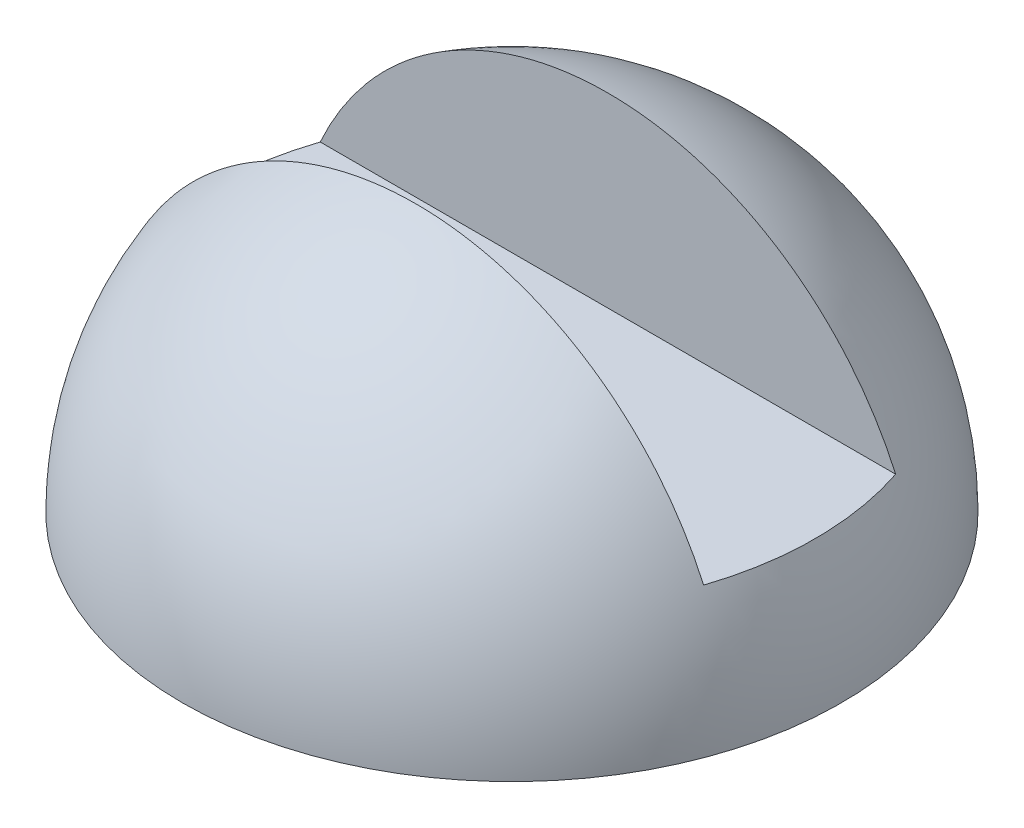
ISO-10303-21;
HEADER;
FILE_DESCRIPTION(('STEP AP214'),'2;1');
FILE_NAME('part.step','',(''),(''),'','','');
FILE_SCHEMA(('AUTOMOTIVE_DESIGN { 1 0 10303 214 1 1 1 1 }'));
ENDSEC;
DATA;
#1=APPLICATION_CONTEXT('core data for automotive mechanical design processes');
#2=APPLICATION_PROTOCOL_DEFINITION('international standard','automotive_design',2000,#1);
#3=PRODUCT_CONTEXT('',#1,'mechanical');
#4=PRODUCT('Part','Part','',(#3));
#5=PRODUCT_RELATED_PRODUCT_CATEGORY('part','',(#4));
#6=PRODUCT_DEFINITION_FORMATION('','',#4);
#7=PRODUCT_DEFINITION_CONTEXT('part definition',#1,'design');
#8=PRODUCT_DEFINITION('design','',#6,#7);
#9=PRODUCT_DEFINITION_SHAPE('','',#8);
#10=(LENGTH_UNIT() NAMED_UNIT(*) SI_UNIT(.MILLI.,.METRE.));
#11=(NAMED_UNIT(*) PLANE_ANGLE_UNIT() SI_UNIT($,.RADIAN.));
#12=(NAMED_UNIT(*) SI_UNIT($,.STERADIAN.) SOLID_ANGLE_UNIT());
#13=UNCERTAINTY_MEASURE_WITH_UNIT(LENGTH_MEASURE(1.E-05),#10,'distance_accuracy_value','');
#14=(GEOMETRIC_REPRESENTATION_CONTEXT(3) GLOBAL_UNCERTAINTY_ASSIGNED_CONTEXT((#13)) GLOBAL_UNIT_ASSIGNED_CONTEXT((#10,
#11,#12)) REPRESENTATION_CONTEXT('',''));
#15=CARTESIAN_POINT('',(0.,0.,0.));
#16=DIRECTION('',(0.,0.,1.));
#17=DIRECTION('',(1.,0.,0.));
#18=AXIS2_PLACEMENT_3D('',#15,#16,#17);
#19=CARTESIAN_POINT('',(0.,0.,0.));
#20=DIRECTION('',(0.,1.,0.));
#21=DIRECTION('',(1.,0.,0.));
#22=AXIS2_PLACEMENT_3D('',#19,#20,#21);
#23=SPHERICAL_SURFACE('',#22,30.0684849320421);
#24=CARTESIAN_POINT('',(0.,0.,-8.75871428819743));
#25=DIRECTION('',(0.,0.,-1.));
#26=DIRECTION('',(-1.,0.,0.));
#27=AXIS2_PLACEMENT_3D('',#24,#25,#26);
#28=CIRCLE('',#27,28.7645391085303);
#29=CARTESIAN_POINT('',(26.246732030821,11.7689323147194,-8.75871428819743));
#30=VERTEX_POINT('',#29);
#31=CARTESIAN_POINT('',(-26.246732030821,11.7689323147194,-8.75871428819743));
#32=VERTEX_POINT('',#31);
#33=EDGE_CURVE('E11',#30,#32,#28,.F.);
#34=ORIENTED_EDGE('',*,*,#33,.F.);
#35=CARTESIAN_POINT('',(0.,11.7689323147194,0.));
#36=DIRECTION('',(0.,-1.,0.));
#37=DIRECTION('',(0.,0.,-1.));
#38=AXIS2_PLACEMENT_3D('',#35,#36,#37);
#39=CIRCLE('',#38,27.6695865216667);
#40=CARTESIAN_POINT('',(26.246732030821,11.7689323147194,8.75871428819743));
#41=VERTEX_POINT('',#40);
#42=EDGE_CURVE('E51',#41,#30,#39,.F.);
#43=ORIENTED_EDGE('',*,*,#42,.F.);
#44=CARTESIAN_POINT('',(0.,0.,8.75871428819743));
#45=DIRECTION('',(0.,0.,1.));
#46=DIRECTION('',(1.,0.,0.));
#47=AXIS2_PLACEMENT_3D('',#44,#45,#46);
#48=CIRCLE('',#47,28.7645391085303);
#49=CARTESIAN_POINT('',(-26.246732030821,11.7689323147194,8.75871428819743));
#50=VERTEX_POINT('',#49);
#51=EDGE_CURVE('E57',#50,#41,#48,.F.);
#52=ORIENTED_EDGE('',*,*,#51,.F.);
#53=EDGE_CURVE('E38',#32,#50,#39,.F.);
#54=ORIENTED_EDGE('',*,*,#53,.F.);
#55=EDGE_LOOP('',(#34,#43,#52,#54));
#56=FACE_BOUND('',#55,.T.);
#57=CARTESIAN_POINT('',(0.,0.,0.));
#58=DIRECTION('',(0.,1.,0.));
#59=DIRECTION('',(0.,0.,1.));
#60=AXIS2_PLACEMENT_3D('',#57,#58,#59);
#61=CIRCLE('',#60,30.0684849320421);
#62=CARTESIAN_POINT('',(0.,0.,30.0684849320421));
#63=VERTEX_POINT('',#62);
#64=EDGE_CURVE('E61',#63,#63,#61,.T.);
#65=ORIENTED_EDGE('',*,*,#64,.T.);
#66=EDGE_LOOP('',(#65));
#67=FACE_BOUND('',#66,.T.);
#68=ADVANCED_FACE('F31',(#56,#67),#23,.T.);
#69=CARTESIAN_POINT('',(-30.0684849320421,0.,0.));
#70=DIRECTION('',(0.,-1.,0.));
#71=DIRECTION('',(0.,0.,-1.));
#72=AXIS2_PLACEMENT_3D('',#69,#70,#71);
#73=PLANE('',#72);
#74=ORIENTED_EDGE('',*,*,#64,.F.);
#75=EDGE_LOOP('',(#74));
#76=FACE_BOUND('',#75,.T.);
#77=ADVANCED_FACE('F74',(#76),#73,.T.);
#78=CARTESIAN_POINT('',(-35.,11.7689323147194,-8.75871428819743));
#79=DIRECTION('',(0.,0.,-1.));
#80=DIRECTION('',(-1.,0.,0.));
#81=AXIS2_PLACEMENT_3D('',#78,#79,#80);
#82=PLANE('',#81);
#83=ORIENTED_EDGE('',*,*,#33,.T.);
#84=DIRECTION('',(1.,0.,0.));
#85=VECTOR('',#84,1.);
#86=CARTESIAN_POINT('',(-35.,11.7689323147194,-8.75871428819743));
#87=LINE('',#86,#85);
#88=EDGE_CURVE('E64',#32,#30,#87,.T.);
#89=ORIENTED_EDGE('',*,*,#88,.T.);
#90=EDGE_LOOP('',(#83,#89));
#91=FACE_BOUND('',#90,.T.);
#92=ADVANCED_FACE('F72',(#91),#82,.F.);
#93=CARTESIAN_POINT('',(-35.,11.7689323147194,-8.75871428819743));
#94=DIRECTION('',(0.,-1.,0.));
#95=DIRECTION('',(0.,0.,-1.));
#96=AXIS2_PLACEMENT_3D('',#93,#94,#95);
#97=PLANE('',#96);
#98=ORIENTED_EDGE('',*,*,#53,.T.);
#99=DIRECTION('',(1.,0.,0.));
#100=VECTOR('',#99,1.);
#101=CARTESIAN_POINT('',(-35.,11.7689323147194,8.75871428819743));
#102=LINE('',#101,#100);
#103=EDGE_CURVE('E44',#50,#41,#102,.T.);
#104=ORIENTED_EDGE('',*,*,#103,.T.);
#105=ORIENTED_EDGE('',*,*,#42,.T.);
#106=ORIENTED_EDGE('',*,*,#88,.F.);
#107=EDGE_LOOP('',(#98,#104,#105,#106));
#108=FACE_BOUND('',#107,.T.);
#109=ADVANCED_FACE('F63',(#108),#97,.F.);
#110=CARTESIAN_POINT('',(-35.,11.7689323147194,8.75871428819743));
#111=DIRECTION('',(0.,0.,1.));
#112=DIRECTION('',(1.,0.,0.));
#113=AXIS2_PLACEMENT_3D('',#110,#111,#112);
#114=PLANE('',#113);
#115=ORIENTED_EDGE('',*,*,#51,.T.);
#116=ORIENTED_EDGE('',*,*,#103,.F.);
#117=EDGE_LOOP('',(#115,#116));
#118=FACE_BOUND('',#117,.T.);
#119=ADVANCED_FACE('F58',(#118),#114,.F.);
#120=CLOSED_SHELL('',(#68,#77,#92,#109,#119));
#121=MANIFOLD_SOLID_BREP('B2',#120);
#122=ADVANCED_BREP_SHAPE_REPRESENTATION('',(#18,#121),#14);
#123=SHAPE_DEFINITION_REPRESENTATION(#9,#122);
ENDSEC;
END-ISO-10303-21;
